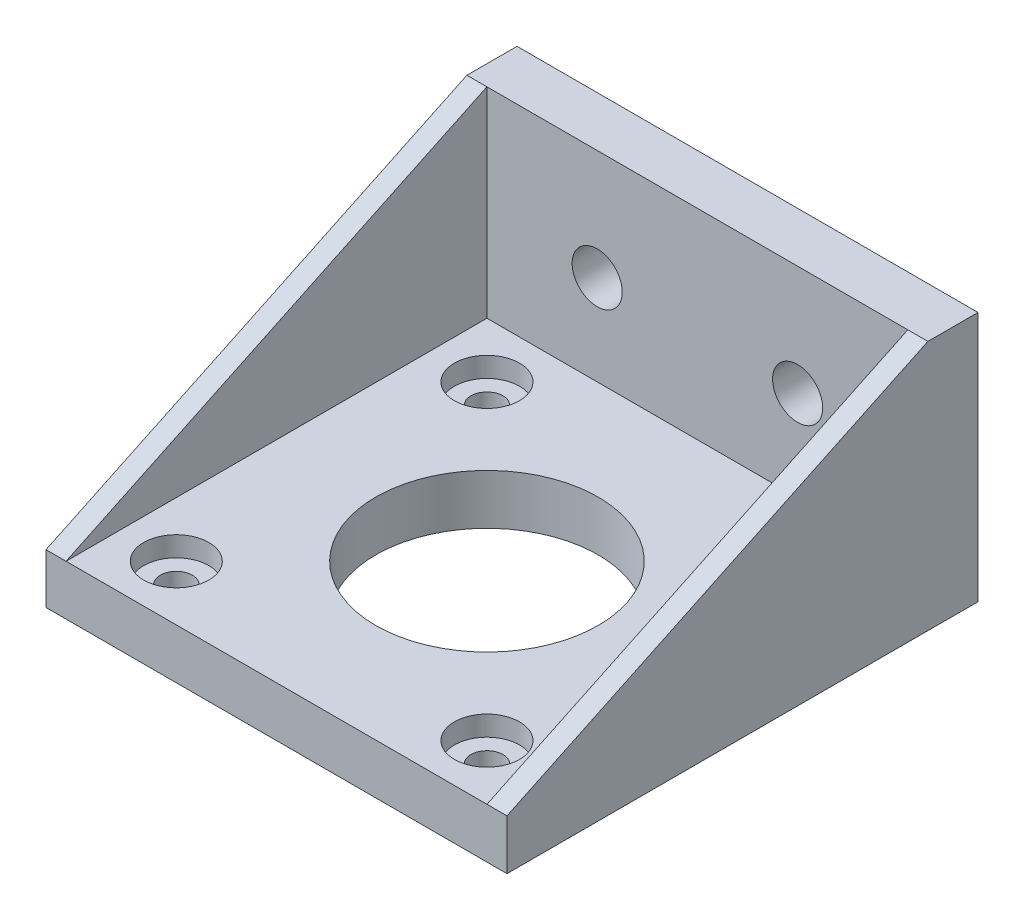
ISO-10303-21;
HEADER;
FILE_DESCRIPTION(('STEP AP214'),'2;1');
FILE_NAME('part.step','',(''),(''),'','','');
FILE_SCHEMA(('AUTOMOTIVE_DESIGN { 1 0 10303 214 1 1 1 1 }'));
ENDSEC;
DATA;
#1=APPLICATION_CONTEXT('core data for automotive mechanical design processes');
#2=APPLICATION_PROTOCOL_DEFINITION('international standard','automotive_design',2000,#1);
#3=PRODUCT_CONTEXT('',#1,'mechanical');
#4=PRODUCT('Part','Part','',(#3));
#5=PRODUCT_RELATED_PRODUCT_CATEGORY('part','',(#4));
#6=PRODUCT_DEFINITION_FORMATION('','',#4);
#7=PRODUCT_DEFINITION_CONTEXT('part definition',#1,'design');
#8=PRODUCT_DEFINITION('design','',#6,#7);
#9=PRODUCT_DEFINITION_SHAPE('','',#8);
#10=(LENGTH_UNIT() NAMED_UNIT(*) SI_UNIT(.MILLI.,.METRE.));
#11=(NAMED_UNIT(*) PLANE_ANGLE_UNIT() SI_UNIT($,.RADIAN.));
#12=(NAMED_UNIT(*) SI_UNIT($,.STERADIAN.) SOLID_ANGLE_UNIT());
#13=UNCERTAINTY_MEASURE_WITH_UNIT(LENGTH_MEASURE(1.E-05),#10,'distance_accuracy_value','');
#14=(GEOMETRIC_REPRESENTATION_CONTEXT(3) GLOBAL_UNCERTAINTY_ASSIGNED_CONTEXT((#13)) GLOBAL_UNIT_ASSIGNED_CONTEXT((#10,
#11,#12)) REPRESENTATION_CONTEXT('',''));
#15=CARTESIAN_POINT('',(0.,0.,0.));
#16=DIRECTION('',(0.,0.,1.));
#17=DIRECTION('',(1.,0.,0.));
#18=AXIS2_PLACEMENT_3D('',#15,#16,#17);
#19=CARTESIAN_POINT('',(-21.,0.,0.));
#20=DIRECTION('',(-1.,0.,0.));
#21=DIRECTION('',(0.,0.,1.));
#22=AXIS2_PLACEMENT_3D('',#19,#20,#21);
#23=PLANE('',#22);
#24=DIRECTION('',(0.,0.,-1.));
#25=VECTOR('',#24,1.);
#26=CARTESIAN_POINT('',(-21.,2.,0.));
#27=LINE('',#26,#25);
#28=CARTESIAN_POINT('',(-21.,1.99999999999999,21.));
#29=VERTEX_POINT('',#28);
#30=CARTESIAN_POINT('',(-21.,1.99999999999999,-21.));
#31=VERTEX_POINT('',#30);
#32=EDGE_CURVE('E104',#29,#31,#27,.T.);
#33=ORIENTED_EDGE('',*,*,#32,.T.);
#34=DIRECTION('',(0.,-1.,0.));
#35=VECTOR('',#34,1.);
#36=CARTESIAN_POINT('',(-21.,0.,-21.));
#37=LINE('',#36,#35);
#38=CARTESIAN_POINT('',(-21.,22.,-21.));
#39=VERTEX_POINT('',#38);
#40=EDGE_CURVE('E79',#39,#31,#37,.T.);
#41=ORIENTED_EDGE('',*,*,#40,.F.);
#42=DIRECTION('',(0.,0.429933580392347,-0.902860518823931));
#43=VECTOR('',#42,1.);
#44=CARTESIAN_POINT('',(-21.,2.,21.));
#45=LINE('',#44,#43);
#46=EDGE_CURVE('E106',#39,#29,#45,.F.);
#47=ORIENTED_EDGE('',*,*,#46,.T.);
#48=EDGE_LOOP('',(#33,#41,#47));
#49=FACE_BOUND('',#48,.T.);
#50=ADVANCED_FACE('F17',(#49),#23,.F.);
#51=CARTESIAN_POINT('',(0.,0.,-21.));
#52=DIRECTION('',(0.,0.,1.));
#53=DIRECTION('',(0.,-1.,0.));
#54=AXIS2_PLACEMENT_3D('',#51,#52,#53);
#55=PLANE('',#54);
#56=CARTESIAN_POINT('',(10.,11.,-21.));
#57=DIRECTION('',(0.,0.,1.));
#58=DIRECTION('',(1.,0.,0.));
#59=AXIS2_PLACEMENT_3D('',#56,#57,#58);
#60=CIRCLE('',#59,2.5);
#61=CARTESIAN_POINT('',(12.5,11.,-21.));
#62=VERTEX_POINT('',#61);
#63=EDGE_CURVE('E160',#62,#62,#60,.F.);
#64=ORIENTED_EDGE('',*,*,#63,.T.);
#65=EDGE_LOOP('',(#64));
#66=FACE_BOUND('',#65,.T.);
#67=CARTESIAN_POINT('',(-10.,11.,-21.));
#68=DIRECTION('',(0.,0.,1.));
#69=DIRECTION('',(1.,0.,0.));
#70=AXIS2_PLACEMENT_3D('',#67,#68,#69);
#71=CIRCLE('',#70,2.5);
#72=CARTESIAN_POINT('',(-7.5,11.,-21.));
#73=VERTEX_POINT('',#72);
#74=EDGE_CURVE('E164',#73,#73,#71,.F.);
#75=ORIENTED_EDGE('',*,*,#74,.T.);
#76=EDGE_LOOP('',(#75));
#77=FACE_BOUND('',#76,.T.);
#78=ORIENTED_EDGE('',*,*,#40,.T.);
#79=DIRECTION('',(1.,0.,0.));
#80=VECTOR('',#79,1.);
#81=CARTESIAN_POINT('',(0.,2.,-21.));
#82=LINE('',#81,#80);
#83=CARTESIAN_POINT('',(21.,1.99999999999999,-21.));
#84=VERTEX_POINT('',#83);
#85=EDGE_CURVE('E82',#31,#84,#82,.T.);
#86=ORIENTED_EDGE('',*,*,#85,.T.);
#87=DIRECTION('',(0.,1.,0.));
#88=VECTOR('',#87,1.);
#89=CARTESIAN_POINT('',(21.,0.,-21.));
#90=LINE('',#89,#88);
#91=CARTESIAN_POINT('',(21.,22.,-21.0000000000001));
#92=VERTEX_POINT('',#91);
#93=EDGE_CURVE('E85',#84,#92,#90,.T.);
#94=ORIENTED_EDGE('',*,*,#93,.T.);
#95=DIRECTION('',(1.,0.,0.));
#96=VECTOR('',#95,1.);
#97=CARTESIAN_POINT('',(21.,22.,-21.0000000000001));
#98=LINE('',#97,#96);
#99=EDGE_CURVE('E288',#92,#39,#98,.F.);
#100=ORIENTED_EDGE('',*,*,#99,.T.);
#101=EDGE_LOOP('',(#78,#86,#94,#100));
#102=FACE_BOUND('',#101,.T.);
#103=ADVANCED_FACE('F84',(#66,#77,#102),#55,.T.);
#104=CARTESIAN_POINT('',(21.,0.,0.));
#105=DIRECTION('',(1.,0.,0.));
#106=DIRECTION('',(0.,0.,-1.));
#107=AXIS2_PLACEMENT_3D('',#104,#105,#106);
#108=PLANE('',#107);
#109=DIRECTION('',(0.,0.,-1.));
#110=VECTOR('',#109,1.);
#111=CARTESIAN_POINT('',(21.,2.,0.));
#112=LINE('',#111,#110);
#113=CARTESIAN_POINT('',(21.,2.,21.));
#114=VERTEX_POINT('',#113);
#115=EDGE_CURVE('E90',#84,#114,#112,.F.);
#116=ORIENTED_EDGE('',*,*,#115,.T.);
#117=DIRECTION('',(0.,-0.429933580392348,0.90286051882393));
#118=VECTOR('',#117,1.);
#119=CARTESIAN_POINT('',(21.,9.7818853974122,4.65804066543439));
#120=LINE('',#119,#118);
#121=EDGE_CURVE('E97',#92,#114,#120,.T.);
#122=ORIENTED_EDGE('',*,*,#121,.F.);
#123=ORIENTED_EDGE('',*,*,#93,.F.);
#124=EDGE_LOOP('',(#116,#122,#123));
#125=FACE_BOUND('',#124,.T.);
#126=ADVANCED_FACE('F94',(#125),#108,.F.);
#127=CARTESIAN_POINT('',(-15.5,0.,15.5));
#128=DIRECTION('',(0.,1.,0.));
#129=DIRECTION('',(0.,0.,1.));
#130=AXIS2_PLACEMENT_3D('',#127,#128,#129);
#131=CYLINDRICAL_SURFACE('',#130,3.25);
#132=CARTESIAN_POINT('',(-15.5,2.,15.5));
#133=DIRECTION('',(0.,1.,0.));
#134=DIRECTION('',(0.,0.,1.));
#135=AXIS2_PLACEMENT_3D('',#132,#133,#134);
#136=CIRCLE('',#135,3.25);
#137=CARTESIAN_POINT('',(-15.5,2.,18.75));
#138=VERTEX_POINT('',#137);
#139=EDGE_CURVE('E20',#138,#138,#136,.T.);
#140=ORIENTED_EDGE('',*,*,#139,.T.);
#141=EDGE_LOOP('',(#140));
#142=FACE_BOUND('',#141,.T.);
#143=CARTESIAN_POINT('',(-15.5,0.,15.5));
#144=DIRECTION('',(0.,1.,0.));
#145=DIRECTION('',(0.,0.,1.));
#146=AXIS2_PLACEMENT_3D('',#143,#144,#145);
#147=CIRCLE('',#146,3.25);
#148=CARTESIAN_POINT('',(-15.5,0.,18.75));
#149=VERTEX_POINT('',#148);
#150=EDGE_CURVE('E156',#149,#149,#147,.T.);
#151=ORIENTED_EDGE('',*,*,#150,.F.);
#152=EDGE_LOOP('',(#151));
#153=FACE_BOUND('',#152,.T.);
#154=ADVANCED_FACE('F178',(#142,#153),#131,.F.);
#155=CARTESIAN_POINT('',(15.5,0.,15.5));
#156=DIRECTION('',(0.,1.,0.));
#157=DIRECTION('',(0.,0.,1.));
#158=AXIS2_PLACEMENT_3D('',#155,#156,#157);
#159=CYLINDRICAL_SURFACE('',#158,3.25);
#160=CARTESIAN_POINT('',(15.5,2.,15.5));
#161=DIRECTION('',(0.,1.,0.));
#162=DIRECTION('',(0.,0.,1.));
#163=AXIS2_PLACEMENT_3D('',#160,#161,#162);
#164=CIRCLE('',#163,3.25);
#165=CARTESIAN_POINT('',(15.5,2.,18.75));
#166=VERTEX_POINT('',#165);
#167=EDGE_CURVE('E171',#166,#166,#164,.T.);
#168=ORIENTED_EDGE('',*,*,#167,.T.);
#169=EDGE_LOOP('',(#168));
#170=FACE_BOUND('',#169,.T.);
#171=CARTESIAN_POINT('',(15.5,0.,15.5));
#172=DIRECTION('',(0.,1.,0.));
#173=DIRECTION('',(0.,0.,1.));
#174=AXIS2_PLACEMENT_3D('',#171,#172,#173);
#175=CIRCLE('',#174,3.25);
#176=CARTESIAN_POINT('',(15.5,0.,18.75));
#177=VERTEX_POINT('',#176);
#178=EDGE_CURVE('E153',#177,#177,#175,.T.);
#179=ORIENTED_EDGE('',*,*,#178,.F.);
#180=EDGE_LOOP('',(#179));
#181=FACE_BOUND('',#180,.T.);
#182=ADVANCED_FACE('F328',(#170,#181),#159,.F.);
#183=CARTESIAN_POINT('',(15.5,0.,-15.5));
#184=DIRECTION('',(0.,1.,0.));
#185=DIRECTION('',(0.,0.,1.));
#186=AXIS2_PLACEMENT_3D('',#183,#184,#185);
#187=CYLINDRICAL_SURFACE('',#186,3.25);
#188=CARTESIAN_POINT('',(15.5,2.,-15.5));
#189=DIRECTION('',(0.,1.,0.));
#190=DIRECTION('',(0.,0.,1.));
#191=AXIS2_PLACEMENT_3D('',#188,#189,#190);
#192=CIRCLE('',#191,3.25);
#193=CARTESIAN_POINT('',(15.5,2.,-12.25));
#194=VERTEX_POINT('',#193);
#195=EDGE_CURVE('E169',#194,#194,#192,.T.);
#196=ORIENTED_EDGE('',*,*,#195,.T.);
#197=EDGE_LOOP('',(#196));
#198=FACE_BOUND('',#197,.T.);
#199=CARTESIAN_POINT('',(15.5,0.,-15.5));
#200=DIRECTION('',(0.,1.,0.));
#201=DIRECTION('',(0.,0.,1.));
#202=AXIS2_PLACEMENT_3D('',#199,#200,#201);
#203=CIRCLE('',#202,3.25);
#204=CARTESIAN_POINT('',(15.5,0.,-12.25));
#205=VERTEX_POINT('',#204);
#206=EDGE_CURVE('E150',#205,#205,#203,.T.);
#207=ORIENTED_EDGE('',*,*,#206,.F.);
#208=EDGE_LOOP('',(#207));
#209=FACE_BOUND('',#208,.T.);
#210=ADVANCED_FACE('F324',(#198,#209),#187,.F.);
#211=CARTESIAN_POINT('',(-15.5,0.,-15.5));
#212=DIRECTION('',(0.,1.,0.));
#213=DIRECTION('',(0.,0.,1.));
#214=AXIS2_PLACEMENT_3D('',#211,#212,#213);
#215=CYLINDRICAL_SURFACE('',#214,3.25);
#216=CARTESIAN_POINT('',(-15.5,2.,-15.5));
#217=DIRECTION('',(0.,1.,0.));
#218=DIRECTION('',(0.,0.,1.));
#219=AXIS2_PLACEMENT_3D('',#216,#217,#218);
#220=CIRCLE('',#219,3.25);
#221=CARTESIAN_POINT('',(-15.5,2.,-12.25));
#222=VERTEX_POINT('',#221);
#223=EDGE_CURVE('E91',#222,#222,#220,.T.);
#224=ORIENTED_EDGE('',*,*,#223,.T.);
#225=EDGE_LOOP('',(#224));
#226=FACE_BOUND('',#225,.T.);
#227=CARTESIAN_POINT('',(-15.5,0.,-15.5));
#228=DIRECTION('',(0.,1.,0.));
#229=DIRECTION('',(0.,0.,1.));
#230=AXIS2_PLACEMENT_3D('',#227,#228,#229);
#231=CIRCLE('',#230,3.25);
#232=CARTESIAN_POINT('',(-15.5,0.,-12.25));
#233=VERTEX_POINT('',#232);
#234=EDGE_CURVE('E147',#233,#233,#231,.T.);
#235=ORIENTED_EDGE('',*,*,#234,.F.);
#236=EDGE_LOOP('',(#235));
#237=FACE_BOUND('',#236,.T.);
#238=ADVANCED_FACE('F184',(#226,#237),#215,.F.);
#239=CARTESIAN_POINT('',(0.,2.,0.));
#240=DIRECTION('',(0.,-1.,0.));
#241=DIRECTION('',(0.,0.,-1.));
#242=AXIS2_PLACEMENT_3D('',#239,#240,#241);
#243=PLANE('',#242);
#244=DIRECTION('',(1.,0.,0.));
#245=VECTOR('',#244,1.);
#246=CARTESIAN_POINT('',(-21.,2.,21.));
#247=LINE('',#246,#245);
#248=EDGE_CURVE('E103',#114,#29,#247,.F.);
#249=ORIENTED_EDGE('',*,*,#248,.F.);
#250=ORIENTED_EDGE('',*,*,#115,.F.);
#251=ORIENTED_EDGE('',*,*,#85,.F.);
#252=ORIENTED_EDGE('',*,*,#32,.F.);
#253=EDGE_LOOP('',(#249,#250,#251,#252));
#254=FACE_BOUND('',#253,.T.);
#255=ORIENTED_EDGE('',*,*,#223,.F.);
#256=EDGE_LOOP('',(#255));
#257=FACE_BOUND('',#256,.T.);
#258=ORIENTED_EDGE('',*,*,#195,.F.);
#259=EDGE_LOOP('',(#258));
#260=FACE_BOUND('',#259,.T.);
#261=ORIENTED_EDGE('',*,*,#167,.F.);
#262=EDGE_LOOP('',(#261));
#263=FACE_BOUND('',#262,.T.);
#264=ORIENTED_EDGE('',*,*,#139,.F.);
#265=EDGE_LOOP('',(#264));
#266=FACE_BOUND('',#265,.T.);
#267=CARTESIAN_POINT('',(0.,2.,0.));
#268=DIRECTION('',(0.,1.,0.));
#269=DIRECTION('',(0.,0.,1.));
#270=AXIS2_PLACEMENT_3D('',#267,#268,#269);
#271=CIRCLE('',#270,11.1);
#272=CARTESIAN_POINT('',(0.,2.,11.1));
#273=VERTEX_POINT('',#272);
#274=EDGE_CURVE('E144',#273,#273,#271,.F.);
#275=ORIENTED_EDGE('',*,*,#274,.T.);
#276=EDGE_LOOP('',(#275));
#277=FACE_BOUND('',#276,.T.);
#278=ADVANCED_FACE('F100',(#254,#257,#260,#263,#266,#277),#243,.F.);
#279=CARTESIAN_POINT('',(-23.,2.,21.));
#280=DIRECTION('',(0.,-0.902860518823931,-0.429933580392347));
#281=DIRECTION('',(0.,0.429933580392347,-0.902860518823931));
#282=AXIS2_PLACEMENT_3D('',#279,#280,#281);
#283=PLANE('',#282);
#284=DIRECTION('',(1.,0.,0.));
#285=VECTOR('',#284,1.);
#286=CARTESIAN_POINT('',(21.,22.,-21.));
#287=LINE('',#286,#285);
#288=CARTESIAN_POINT('',(-23.,22.,-21.0000000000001));
#289=VERTEX_POINT('',#288);
#290=EDGE_CURVE('E163',#39,#289,#287,.F.);
#291=ORIENTED_EDGE('',*,*,#290,.T.);
#292=DIRECTION('',(0.,0.429933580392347,-0.90286051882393));
#293=VECTOR('',#292,1.);
#294=CARTESIAN_POINT('',(-23.,2.,21.));
#295=LINE('',#294,#293);
#296=CARTESIAN_POINT('',(-23.,2.,21.));
#297=VERTEX_POINT('',#296);
#298=EDGE_CURVE('E275',#297,#289,#295,.T.);
#299=ORIENTED_EDGE('',*,*,#298,.F.);
#300=DIRECTION('',(1.,0.,0.));
#301=VECTOR('',#300,1.);
#302=CARTESIAN_POINT('',(-21.,2.,21.));
#303=LINE('',#302,#301);
#304=EDGE_CURVE('E282',#29,#297,#303,.F.);
#305=ORIENTED_EDGE('',*,*,#304,.F.);
#306=ORIENTED_EDGE('',*,*,#46,.F.);
#307=EDGE_LOOP('',(#291,#299,#305,#306));
#308=FACE_BOUND('',#307,.T.);
#309=ADVANCED_FACE('F183',(#308),#283,.F.);
#310=CARTESIAN_POINT('',(-10.,11.,-33.));
#311=DIRECTION('',(0.,0.,1.));
#312=DIRECTION('',(1.,0.,0.));
#313=AXIS2_PLACEMENT_3D('',#310,#311,#312);
#314=CYLINDRICAL_SURFACE('',#313,2.5);
#315=CARTESIAN_POINT('',(-10.,11.,-26.));
#316=DIRECTION('',(0.,0.,1.));
#317=DIRECTION('',(1.,0.,0.));
#318=AXIS2_PLACEMENT_3D('',#315,#316,#317);
#319=CIRCLE('',#318,2.5);
#320=CARTESIAN_POINT('',(-7.5,11.,-26.));
#321=VERTEX_POINT('',#320);
#322=EDGE_CURVE('E140',#321,#321,#319,.F.);
#323=ORIENTED_EDGE('',*,*,#322,.T.);
#324=EDGE_LOOP('',(#323));
#325=FACE_BOUND('',#324,.T.);
#326=ORIENTED_EDGE('',*,*,#74,.F.);
#327=EDGE_LOOP('',(#326));
#328=FACE_BOUND('',#327,.T.);
#329=ADVANCED_FACE('F312',(#325,#328),#314,.F.);
#330=CARTESIAN_POINT('',(10.,11.,-33.));
#331=DIRECTION('',(0.,0.,1.));
#332=DIRECTION('',(1.,0.,0.));
#333=AXIS2_PLACEMENT_3D('',#330,#331,#332);
#334=CYLINDRICAL_SURFACE('',#333,2.5);
#335=CARTESIAN_POINT('',(10.,11.,-26.));
#336=DIRECTION('',(0.,0.,1.));
#337=DIRECTION('',(1.,0.,0.));
#338=AXIS2_PLACEMENT_3D('',#335,#336,#337);
#339=CIRCLE('',#338,2.5);
#340=CARTESIAN_POINT('',(12.5,11.,-26.));
#341=VERTEX_POINT('',#340);
#342=EDGE_CURVE('E137',#341,#341,#339,.F.);
#343=ORIENTED_EDGE('',*,*,#342,.T.);
#344=EDGE_LOOP('',(#343));
#345=FACE_BOUND('',#344,.T.);
#346=ORIENTED_EDGE('',*,*,#63,.F.);
#347=EDGE_LOOP('',(#346));
#348=FACE_BOUND('',#347,.T.);
#349=ADVANCED_FACE('F304',(#345,#348),#334,.F.);
#350=CARTESIAN_POINT('',(21.,22.,-26.));
#351=DIRECTION('',(0.,-1.,0.));
#352=DIRECTION('',(0.,0.,-1.));
#353=AXIS2_PLACEMENT_3D('',#350,#351,#352);
#354=PLANE('',#353);
#355=DIRECTION('',(1.,0.,0.));
#356=VECTOR('',#355,1.);
#357=CARTESIAN_POINT('',(23.,22.,-21.0000000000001));
#358=LINE('',#357,#356);
#359=CARTESIAN_POINT('',(23.,22.,-21.0000000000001));
#360=VERTEX_POINT('',#359);
#361=EDGE_CURVE('E159',#360,#92,#358,.F.);
#362=ORIENTED_EDGE('',*,*,#361,.F.);
#363=DIRECTION('',(0.,0.,-1.));
#364=VECTOR('',#363,1.);
#365=CARTESIAN_POINT('',(23.,22.,0.));
#366=LINE('',#365,#364);
#367=CARTESIAN_POINT('',(23.,22.,-26.0000000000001));
#368=VERTEX_POINT('',#367);
#369=EDGE_CURVE('E269',#368,#360,#366,.F.);
#370=ORIENTED_EDGE('',*,*,#369,.F.);
#371=DIRECTION('',(1.,0.,0.));
#372=VECTOR('',#371,1.);
#373=CARTESIAN_POINT('',(0.,22.,-26.0000000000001));
#374=LINE('',#373,#372);
#375=CARTESIAN_POINT('',(-23.,22.,-26.0000000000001));
#376=VERTEX_POINT('',#375);
#377=EDGE_CURVE('E252',#368,#376,#374,.F.);
#378=ORIENTED_EDGE('',*,*,#377,.T.);
#379=DIRECTION('',(0.,0.,1.));
#380=VECTOR('',#379,1.);
#381=CARTESIAN_POINT('',(-23.,22.,0.));
#382=LINE('',#381,#380);
#383=EDGE_CURVE('E251',#289,#376,#382,.F.);
#384=ORIENTED_EDGE('',*,*,#383,.F.);
#385=ORIENTED_EDGE('',*,*,#290,.F.);
#386=ORIENTED_EDGE('',*,*,#99,.F.);
#387=EDGE_LOOP('',(#362,#370,#378,#384,#385,#386));
#388=FACE_BOUND('',#387,.T.);
#389=ADVANCED_FACE('F301',(#388),#354,.F.);
#390=CARTESIAN_POINT('',(23.,9.7818853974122,4.65804066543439));
#391=DIRECTION('',(0.,0.90286051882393,0.429933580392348));
#392=DIRECTION('',(0.,-0.429933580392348,0.90286051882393));
#393=AXIS2_PLACEMENT_3D('',#390,#391,#392);
#394=PLANE('',#393);
#395=DIRECTION('',(0.,-0.429933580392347,0.90286051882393));
#396=VECTOR('',#395,1.);
#397=CARTESIAN_POINT('',(23.,22.,-21.0000000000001));
#398=LINE('',#397,#396);
#399=CARTESIAN_POINT('',(23.,2.,21.));
#400=VERTEX_POINT('',#399);
#401=EDGE_CURVE('E266',#360,#400,#398,.T.);
#402=ORIENTED_EDGE('',*,*,#401,.F.);
#403=ORIENTED_EDGE('',*,*,#361,.T.);
#404=ORIENTED_EDGE('',*,*,#121,.T.);
#405=DIRECTION('',(1.,0.,0.));
#406=VECTOR('',#405,1.);
#407=CARTESIAN_POINT('',(-21.,2.,21.));
#408=LINE('',#407,#406);
#409=EDGE_CURVE('E279',#400,#114,#408,.F.);
#410=ORIENTED_EDGE('',*,*,#409,.F.);
#411=EDGE_LOOP('',(#402,#403,#404,#410));
#412=FACE_BOUND('',#411,.T.);
#413=ADVANCED_FACE('F298',(#412),#394,.T.);
#414=CARTESIAN_POINT('',(-15.5,0.,15.5));
#415=DIRECTION('',(0.,1.,0.));
#416=DIRECTION('',(0.,0.,1.));
#417=AXIS2_PLACEMENT_3D('',#414,#415,#416);
#418=PLANE('',#417);
#419=CARTESIAN_POINT('',(-15.5,0.,15.5));
#420=DIRECTION('',(0.,1.,0.));
#421=DIRECTION('',(0.,0.,1.));
#422=AXIS2_PLACEMENT_3D('',#419,#420,#421);
#423=CIRCLE('',#422,1.6);
#424=CARTESIAN_POINT('',(-15.5,0.,17.1));
#425=VERTEX_POINT('',#424);
#426=EDGE_CURVE('E133',#425,#425,#423,.F.);
#427=ORIENTED_EDGE('',*,*,#426,.T.);
#428=EDGE_LOOP('',(#427));
#429=FACE_BOUND('',#428,.T.);
#430=ORIENTED_EDGE('',*,*,#150,.T.);
#431=EDGE_LOOP('',(#430));
#432=FACE_BOUND('',#431,.T.);
#433=ADVANCED_FACE('F310',(#429,#432),#418,.T.);
#434=CARTESIAN_POINT('',(15.5,0.,15.5));
#435=DIRECTION('',(0.,1.,0.));
#436=DIRECTION('',(0.,0.,1.));
#437=AXIS2_PLACEMENT_3D('',#434,#435,#436);
#438=PLANE('',#437);
#439=CARTESIAN_POINT('',(15.5,0.,15.5));
#440=DIRECTION('',(0.,1.,0.));
#441=DIRECTION('',(0.,0.,1.));
#442=AXIS2_PLACEMENT_3D('',#439,#440,#441);
#443=CIRCLE('',#442,1.6);
#444=CARTESIAN_POINT('',(15.5,0.,17.1));
#445=VERTEX_POINT('',#444);
#446=EDGE_CURVE('E130',#445,#445,#443,.F.);
#447=ORIENTED_EDGE('',*,*,#446,.T.);
#448=EDGE_LOOP('',(#447));
#449=FACE_BOUND('',#448,.T.);
#450=ORIENTED_EDGE('',*,*,#178,.T.);
#451=EDGE_LOOP('',(#450));
#452=FACE_BOUND('',#451,.T.);
#453=ADVANCED_FACE('F429',(#449,#452),#438,.T.);
#454=CARTESIAN_POINT('',(15.5,0.,-15.5));
#455=DIRECTION('',(0.,1.,0.));
#456=DIRECTION('',(0.,0.,1.));
#457=AXIS2_PLACEMENT_3D('',#454,#455,#456);
#458=PLANE('',#457);
#459=CARTESIAN_POINT('',(15.5,0.,-15.5));
#460=DIRECTION('',(0.,1.,0.));
#461=DIRECTION('',(0.,0.,1.));
#462=AXIS2_PLACEMENT_3D('',#459,#460,#461);
#463=CIRCLE('',#462,1.6);
#464=CARTESIAN_POINT('',(15.5,0.,-13.9));
#465=VERTEX_POINT('',#464);
#466=EDGE_CURVE('E127',#465,#465,#463,.F.);
#467=ORIENTED_EDGE('',*,*,#466,.T.);
#468=EDGE_LOOP('',(#467));
#469=FACE_BOUND('',#468,.T.);
#470=ORIENTED_EDGE('',*,*,#206,.T.);
#471=EDGE_LOOP('',(#470));
#472=FACE_BOUND('',#471,.T.);
#473=ADVANCED_FACE('F202',(#469,#472),#458,.T.);
#474=CARTESIAN_POINT('',(-15.5,0.,-15.5));
#475=DIRECTION('',(0.,1.,0.));
#476=DIRECTION('',(0.,0.,1.));
#477=AXIS2_PLACEMENT_3D('',#474,#475,#476);
#478=PLANE('',#477);
#479=CARTESIAN_POINT('',(-15.5,0.,-15.5));
#480=DIRECTION('',(0.,1.,0.));
#481=DIRECTION('',(0.,0.,1.));
#482=AXIS2_PLACEMENT_3D('',#479,#480,#481);
#483=CIRCLE('',#482,1.6);
#484=CARTESIAN_POINT('',(-15.5,0.,-13.9));
#485=VERTEX_POINT('',#484);
#486=EDGE_CURVE('E124',#485,#485,#483,.F.);
#487=ORIENTED_EDGE('',*,*,#486,.T.);
#488=EDGE_LOOP('',(#487));
#489=FACE_BOUND('',#488,.T.);
#490=ORIENTED_EDGE('',*,*,#234,.T.);
#491=EDGE_LOOP('',(#490));
#492=FACE_BOUND('',#491,.T.);
#493=ADVANCED_FACE('F191',(#489,#492),#478,.T.);
#494=CARTESIAN_POINT('',(0.,-114.,0.));
#495=DIRECTION('',(0.,1.,0.));
#496=DIRECTION('',(0.,0.,1.));
#497=AXIS2_PLACEMENT_3D('',#494,#495,#496);
#498=CYLINDRICAL_SURFACE('',#497,11.1);
#499=CARTESIAN_POINT('',(0.,-3.,0.));
#500=DIRECTION('',(0.,1.,0.));
#501=DIRECTION('',(0.,0.,1.));
#502=AXIS2_PLACEMENT_3D('',#499,#500,#501);
#503=CIRCLE('',#502,11.1);
#504=CARTESIAN_POINT('',(0.,-3.,11.1));
#505=VERTEX_POINT('',#504);
#506=EDGE_CURVE('E120',#505,#505,#503,.T.);
#507=ORIENTED_EDGE('',*,*,#506,.F.);
#508=EDGE_LOOP('',(#507));
#509=FACE_BOUND('',#508,.T.);
#510=ORIENTED_EDGE('',*,*,#274,.F.);
#511=EDGE_LOOP('',(#510));
#512=FACE_BOUND('',#511,.T.);
#513=ADVANCED_FACE('F188',(#509,#512),#498,.F.);
#514=CARTESIAN_POINT('',(-21.,-3.,21.));
#515=DIRECTION('',(0.,0.,1.));
#516=DIRECTION('',(1.,0.,0.));
#517=AXIS2_PLACEMENT_3D('',#514,#515,#516);
#518=PLANE('',#517);
#519=DIRECTION('',(0.,1.,0.));
#520=VECTOR('',#519,1.);
#521=CARTESIAN_POINT('',(23.,0.,21.));
#522=LINE('',#521,#520);
#523=CARTESIAN_POINT('',(23.,-3.,21.));
#524=VERTEX_POINT('',#523);
#525=EDGE_CURVE('E136',#400,#524,#522,.F.);
#526=ORIENTED_EDGE('',*,*,#525,.F.);
#527=ORIENTED_EDGE('',*,*,#409,.T.);
#528=ORIENTED_EDGE('',*,*,#248,.T.);
#529=ORIENTED_EDGE('',*,*,#304,.T.);
#530=DIRECTION('',(0.,1.,0.));
#531=VECTOR('',#530,1.);
#532=CARTESIAN_POINT('',(-23.,0.,21.));
#533=LINE('',#532,#531);
#534=CARTESIAN_POINT('',(-23.,-3.,21.));
#535=VERTEX_POINT('',#534);
#536=EDGE_CURVE('E277',#535,#297,#533,.T.);
#537=ORIENTED_EDGE('',*,*,#536,.F.);
#538=DIRECTION('',(1.,0.,0.));
#539=VECTOR('',#538,1.);
#540=CARTESIAN_POINT('',(0.,-3.,21.));
#541=LINE('',#540,#539);
#542=EDGE_CURVE('E123',#524,#535,#541,.F.);
#543=ORIENTED_EDGE('',*,*,#542,.F.);
#544=EDGE_LOOP('',(#526,#527,#528,#529,#537,#543));
#545=FACE_BOUND('',#544,.T.);
#546=ADVANCED_FACE('F190',(#545),#518,.T.);
#547=CARTESIAN_POINT('',(-23.,0.,0.));
#548=DIRECTION('',(-1.,0.,0.));
#549=DIRECTION('',(0.,0.,1.));
#550=AXIS2_PLACEMENT_3D('',#547,#548,#549);
#551=PLANE('',#550);
#552=DIRECTION('',(0.,-1.,0.));
#553=VECTOR('',#552,1.);
#554=CARTESIAN_POINT('',(-23.,0.,-26.));
#555=LINE('',#554,#553);
#556=CARTESIAN_POINT('',(-23.,-3.,-26.));
#557=VERTEX_POINT('',#556);
#558=EDGE_CURVE('E143',#376,#557,#555,.T.);
#559=ORIENTED_EDGE('',*,*,#558,.T.);
#560=DIRECTION('',(0.,0.,-1.));
#561=VECTOR('',#560,1.);
#562=CARTESIAN_POINT('',(-23.,-3.,0.));
#563=LINE('',#562,#561);
#564=EDGE_CURVE('E247',#535,#557,#563,.T.);
#565=ORIENTED_EDGE('',*,*,#564,.F.);
#566=ORIENTED_EDGE('',*,*,#536,.T.);
#567=ORIENTED_EDGE('',*,*,#298,.T.);
#568=ORIENTED_EDGE('',*,*,#383,.T.);
#569=EDGE_LOOP('',(#559,#565,#566,#567,#568));
#570=FACE_BOUND('',#569,.T.);
#571=ADVANCED_FACE('F199',(#570),#551,.T.);
#572=CARTESIAN_POINT('',(0.,0.,-26.));
#573=DIRECTION('',(0.,0.,1.));
#574=DIRECTION('',(0.,-1.,0.));
#575=AXIS2_PLACEMENT_3D('',#572,#573,#574);
#576=PLANE('',#575);
#577=ORIENTED_EDGE('',*,*,#342,.F.);
#578=EDGE_LOOP('',(#577));
#579=FACE_BOUND('',#578,.T.);
#580=ORIENTED_EDGE('',*,*,#322,.F.);
#581=EDGE_LOOP('',(#580));
#582=FACE_BOUND('',#581,.T.);
#583=ORIENTED_EDGE('',*,*,#377,.F.);
#584=DIRECTION('',(0.,1.,0.));
#585=VECTOR('',#584,1.);
#586=CARTESIAN_POINT('',(23.,0.,-26.));
#587=LINE('',#586,#585);
#588=CARTESIAN_POINT('',(23.,-3.,-26.));
#589=VERTEX_POINT('',#588);
#590=EDGE_CURVE('E35',#589,#368,#587,.T.);
#591=ORIENTED_EDGE('',*,*,#590,.F.);
#592=DIRECTION('',(1.,0.,0.));
#593=VECTOR('',#592,1.);
#594=CARTESIAN_POINT('',(0.,-3.,-26.));
#595=LINE('',#594,#593);
#596=EDGE_CURVE('E255',#557,#589,#595,.T.);
#597=ORIENTED_EDGE('',*,*,#596,.F.);
#598=ORIENTED_EDGE('',*,*,#558,.F.);
#599=EDGE_LOOP('',(#583,#591,#597,#598));
#600=FACE_BOUND('',#599,.T.);
#601=ADVANCED_FACE('F233',(#579,#582,#600),#576,.F.);
#602=CARTESIAN_POINT('',(23.,0.,0.));
#603=DIRECTION('',(1.,0.,0.));
#604=DIRECTION('',(0.,0.,-1.));
#605=AXIS2_PLACEMENT_3D('',#602,#603,#604);
#606=PLANE('',#605);
#607=ORIENTED_EDGE('',*,*,#401,.T.);
#608=ORIENTED_EDGE('',*,*,#525,.T.);
#609=DIRECTION('',(0.,0.,-1.));
#610=VECTOR('',#609,1.);
#611=CARTESIAN_POINT('',(23.,-3.,0.));
#612=LINE('',#611,#610);
#613=EDGE_CURVE('E119',#589,#524,#612,.F.);
#614=ORIENTED_EDGE('',*,*,#613,.F.);
#615=ORIENTED_EDGE('',*,*,#590,.T.);
#616=ORIENTED_EDGE('',*,*,#369,.T.);
#617=EDGE_LOOP('',(#607,#608,#614,#615,#616));
#618=FACE_BOUND('',#617,.T.);
#619=ADVANCED_FACE('F229',(#618),#606,.T.);
#620=CARTESIAN_POINT('',(-15.5,-3.,15.5));
#621=DIRECTION('',(0.,1.,0.));
#622=DIRECTION('',(0.,0.,1.));
#623=AXIS2_PLACEMENT_3D('',#620,#621,#622);
#624=CYLINDRICAL_SURFACE('',#623,1.6);
#625=CARTESIAN_POINT('',(-15.5,-3.,15.5));
#626=DIRECTION('',(0.,1.,0.));
#627=DIRECTION('',(0.,0.,1.));
#628=AXIS2_PLACEMENT_3D('',#625,#626,#627);
#629=CIRCLE('',#628,1.6);
#630=CARTESIAN_POINT('',(-15.5,-3.,17.1));
#631=VERTEX_POINT('',#630);
#632=EDGE_CURVE('E116',#631,#631,#629,.T.);
#633=ORIENTED_EDGE('',*,*,#632,.F.);
#634=EDGE_LOOP('',(#633));
#635=FACE_BOUND('',#634,.T.);
#636=ORIENTED_EDGE('',*,*,#426,.F.);
#637=EDGE_LOOP('',(#636));
#638=FACE_BOUND('',#637,.T.);
#639=ADVANCED_FACE('F225',(#635,#638),#624,.F.);
#640=CARTESIAN_POINT('',(15.5,-3.,15.5));
#641=DIRECTION('',(0.,1.,0.));
#642=DIRECTION('',(0.,0.,1.));
#643=AXIS2_PLACEMENT_3D('',#640,#641,#642);
#644=CYLINDRICAL_SURFACE('',#643,1.6);
#645=CARTESIAN_POINT('',(15.5,-3.,15.5));
#646=DIRECTION('',(0.,1.,0.));
#647=DIRECTION('',(0.,0.,1.));
#648=AXIS2_PLACEMENT_3D('',#645,#646,#647);
#649=CIRCLE('',#648,1.6);
#650=CARTESIAN_POINT('',(15.5,-3.,17.1));
#651=VERTEX_POINT('',#650);
#652=EDGE_CURVE('E113',#651,#651,#649,.T.);
#653=ORIENTED_EDGE('',*,*,#652,.F.);
#654=EDGE_LOOP('',(#653));
#655=FACE_BOUND('',#654,.T.);
#656=ORIENTED_EDGE('',*,*,#446,.F.);
#657=EDGE_LOOP('',(#656));
#658=FACE_BOUND('',#657,.T.);
#659=ADVANCED_FACE('F221',(#655,#658),#644,.F.);
#660=CARTESIAN_POINT('',(15.5,-3.,-15.5));
#661=DIRECTION('',(0.,1.,0.));
#662=DIRECTION('',(0.,0.,1.));
#663=AXIS2_PLACEMENT_3D('',#660,#661,#662);
#664=CYLINDRICAL_SURFACE('',#663,1.6);
#665=CARTESIAN_POINT('',(15.5,-3.,-15.5));
#666=DIRECTION('',(0.,1.,0.));
#667=DIRECTION('',(0.,0.,1.));
#668=AXIS2_PLACEMENT_3D('',#665,#666,#667);
#669=CIRCLE('',#668,1.6);
#670=CARTESIAN_POINT('',(15.5,-3.,-13.9));
#671=VERTEX_POINT('',#670);
#672=EDGE_CURVE('E26',#671,#671,#669,.T.);
#673=ORIENTED_EDGE('',*,*,#672,.F.);
#674=EDGE_LOOP('',(#673));
#675=FACE_BOUND('',#674,.T.);
#676=ORIENTED_EDGE('',*,*,#466,.F.);
#677=EDGE_LOOP('',(#676));
#678=FACE_BOUND('',#677,.T.);
#679=ADVANCED_FACE('F214',(#675,#678),#664,.F.);
#680=CARTESIAN_POINT('',(-15.5,-3.,-15.5));
#681=DIRECTION('',(0.,1.,0.));
#682=DIRECTION('',(0.,0.,1.));
#683=AXIS2_PLACEMENT_3D('',#680,#681,#682);
#684=CYLINDRICAL_SURFACE('',#683,1.6);
#685=CARTESIAN_POINT('',(-15.5,-3.,-15.5));
#686=DIRECTION('',(0.,1.,0.));
#687=DIRECTION('',(0.,0.,1.));
#688=AXIS2_PLACEMENT_3D('',#685,#686,#687);
#689=CIRCLE('',#688,1.6);
#690=CARTESIAN_POINT('',(-15.5,-3.,-13.9));
#691=VERTEX_POINT('',#690);
#692=EDGE_CURVE('E11',#691,#691,#689,.T.);
#693=ORIENTED_EDGE('',*,*,#692,.F.);
#694=EDGE_LOOP('',(#693));
#695=FACE_BOUND('',#694,.T.);
#696=ORIENTED_EDGE('',*,*,#486,.F.);
#697=EDGE_LOOP('',(#696));
#698=FACE_BOUND('',#697,.T.);
#699=ADVANCED_FACE('F208',(#695,#698),#684,.F.);
#700=CARTESIAN_POINT('',(0.,-3.,0.));
#701=DIRECTION('',(0.,-1.,0.));
#702=DIRECTION('',(0.,0.,-1.));
#703=AXIS2_PLACEMENT_3D('',#700,#701,#702);
#704=PLANE('',#703);
#705=ORIENTED_EDGE('',*,*,#692,.T.);
#706=EDGE_LOOP('',(#705));
#707=FACE_BOUND('',#706,.T.);
#708=ORIENTED_EDGE('',*,*,#672,.T.);
#709=EDGE_LOOP('',(#708));
#710=FACE_BOUND('',#709,.T.);
#711=ORIENTED_EDGE('',*,*,#652,.T.);
#712=EDGE_LOOP('',(#711));
#713=FACE_BOUND('',#712,.T.);
#714=ORIENTED_EDGE('',*,*,#632,.T.);
#715=EDGE_LOOP('',(#714));
#716=FACE_BOUND('',#715,.T.);
#717=ORIENTED_EDGE('',*,*,#596,.T.);
#718=ORIENTED_EDGE('',*,*,#613,.T.);
#719=ORIENTED_EDGE('',*,*,#542,.T.);
#720=ORIENTED_EDGE('',*,*,#564,.T.);
#721=EDGE_LOOP('',(#717,#718,#719,#720));
#722=FACE_BOUND('',#721,.T.);
#723=ORIENTED_EDGE('',*,*,#506,.T.);
#724=EDGE_LOOP('',(#723));
#725=FACE_BOUND('',#724,.T.);
#726=ADVANCED_FACE('F206',(#707,#710,#713,#716,#722,#725),#704,.T.);
#727=CLOSED_SHELL('',(#50,#103,#126,#154,#182,#210,#238,#278,#309,#329,#349,#389,#413,#433,#453,
#473,#493,#513,#546,#571,#601,#619,#639,#659,#679,#699,#726));
#728=MANIFOLD_SOLID_BREP('B1',#727);
#729=ADVANCED_BREP_SHAPE_REPRESENTATION('',(#18,#728),#14);
#730=SHAPE_DEFINITION_REPRESENTATION(#9,#729);
ENDSEC;
END-ISO-10303-21;
